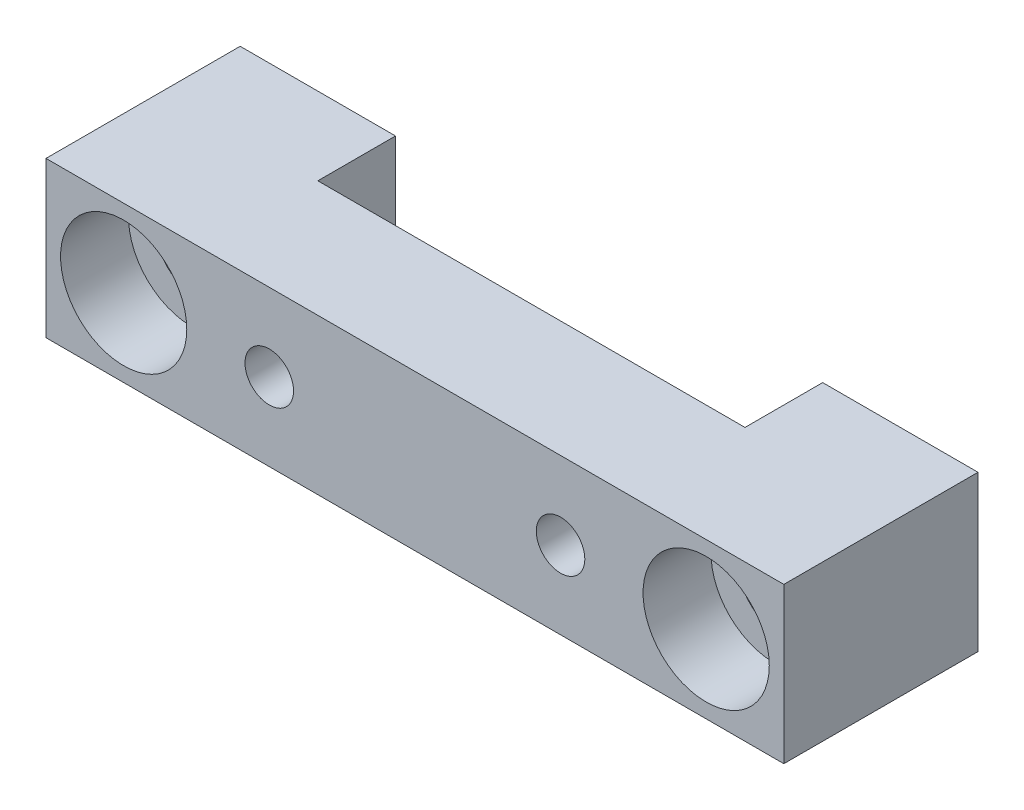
ISO-10303-21;
HEADER;
FILE_DESCRIPTION(('STEP AP214'),'2;1');
FILE_NAME('part.step','',(''),(''),'','','');
FILE_SCHEMA(('AUTOMOTIVE_DESIGN { 1 0 10303 214 1 1 1 1 }'));
ENDSEC;
DATA;
#1=APPLICATION_CONTEXT('core data for automotive mechanical design processes');
#2=APPLICATION_PROTOCOL_DEFINITION('international standard','automotive_design',2000,#1);
#3=PRODUCT_CONTEXT('',#1,'mechanical');
#4=PRODUCT('Part','Part','',(#3));
#5=PRODUCT_RELATED_PRODUCT_CATEGORY('part','',(#4));
#6=PRODUCT_DEFINITION_FORMATION('','',#4);
#7=PRODUCT_DEFINITION_CONTEXT('part definition',#1,'design');
#8=PRODUCT_DEFINITION('design','',#6,#7);
#9=PRODUCT_DEFINITION_SHAPE('','',#8);
#10=(LENGTH_UNIT() NAMED_UNIT(*) SI_UNIT(.MILLI.,.METRE.));
#11=(NAMED_UNIT(*) PLANE_ANGLE_UNIT() SI_UNIT($,.RADIAN.));
#12=(NAMED_UNIT(*) SI_UNIT($,.STERADIAN.) SOLID_ANGLE_UNIT());
#13=UNCERTAINTY_MEASURE_WITH_UNIT(LENGTH_MEASURE(1.E-05),#10,'distance_accuracy_value','');
#14=(GEOMETRIC_REPRESENTATION_CONTEXT(3) GLOBAL_UNCERTAINTY_ASSIGNED_CONTEXT((#13)) GLOBAL_UNIT_ASSIGNED_CONTEXT((#10,
#11,#12)) REPRESENTATION_CONTEXT('',''));
#15=CARTESIAN_POINT('',(0.,0.,0.));
#16=DIRECTION('',(0.,0.,1.));
#17=DIRECTION('',(1.,0.,0.));
#18=AXIS2_PLACEMENT_3D('',#15,#16,#17);
#19=CARTESIAN_POINT('',(0.,8.,0.));
#20=DIRECTION('',(0.,0.,-1.));
#21=DIRECTION('',(-1.,0.,0.));
#22=AXIS2_PLACEMENT_3D('',#19,#20,#21);
#23=PLANE('',#22);
#24=CARTESIAN_POINT('',(34.,4.00000000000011,0.));
#25=DIRECTION('',(0.,0.,1.));
#26=DIRECTION('',(1.,0.,0.));
#27=AXIS2_PLACEMENT_3D('',#24,#25,#26);
#28=CIRCLE('',#27,1.75);
#29=CARTESIAN_POINT('',(35.75,4.00000000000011,0.));
#30=VERTEX_POINT('',#29);
#31=EDGE_CURVE('E167',#30,#30,#28,.T.);
#32=ORIENTED_EDGE('',*,*,#31,.T.);
#33=EDGE_LOOP('',(#32));
#34=FACE_BOUND('',#33,.T.);
#35=DIRECTION('',(1.,0.,0.));
#36=VECTOR('',#35,1.);
#37=CARTESIAN_POINT('',(0.,0.,0.));
#38=LINE('',#37,#36);
#39=CARTESIAN_POINT('',(30.,0.,0.));
#40=VERTEX_POINT('',#39);
#41=CARTESIAN_POINT('',(38.,0.,0.));
#42=VERTEX_POINT('',#41);
#43=EDGE_CURVE('E181',#40,#42,#38,.T.);
#44=ORIENTED_EDGE('',*,*,#43,.F.);
#45=DIRECTION('',(0.,1.,0.));
#46=VECTOR('',#45,1.);
#47=CARTESIAN_POINT('',(30.,0.,0.));
#48=LINE('',#47,#46);
#49=CARTESIAN_POINT('',(30.,8.,0.));
#50=VERTEX_POINT('',#49);
#51=EDGE_CURVE('E137',#40,#50,#48,.T.);
#52=ORIENTED_EDGE('',*,*,#51,.T.);
#53=DIRECTION('',(-1.,0.,0.));
#54=VECTOR('',#53,1.);
#55=CARTESIAN_POINT('',(0.,8.,0.));
#56=LINE('',#55,#54);
#57=CARTESIAN_POINT('',(38.,8.,0.));
#58=VERTEX_POINT('',#57);
#59=EDGE_CURVE('E173',#58,#50,#56,.T.);
#60=ORIENTED_EDGE('',*,*,#59,.F.);
#61=DIRECTION('',(0.,1.,0.));
#62=VECTOR('',#61,1.);
#63=CARTESIAN_POINT('',(38.,0.,0.));
#64=LINE('',#63,#62);
#65=EDGE_CURVE('E183',#42,#58,#64,.T.);
#66=ORIENTED_EDGE('',*,*,#65,.F.);
#67=EDGE_LOOP('',(#44,#52,#60,#66));
#68=FACE_BOUND('',#67,.T.);
#69=ADVANCED_FACE('F33',(#34,#68),#23,.T.);
#70=CARTESIAN_POINT('',(4.,4.00000000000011,0.));
#71=DIRECTION('',(0.,0.,1.));
#72=DIRECTION('',(1.,0.,0.));
#73=AXIS2_PLACEMENT_3D('',#70,#71,#72);
#74=CIRCLE('',#73,1.75);
#75=CARTESIAN_POINT('',(5.75,4.00000000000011,0.));
#76=VERTEX_POINT('',#75);
#77=EDGE_CURVE('E164',#76,#76,#74,.T.);
#78=ORIENTED_EDGE('',*,*,#77,.T.);
#79=EDGE_LOOP('',(#78));
#80=FACE_BOUND('',#79,.T.);
#81=CARTESIAN_POINT('',(7.99999999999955,8.,0.));
#82=VERTEX_POINT('',#81);
#83=CARTESIAN_POINT('',(0.,8.,0.));
#84=VERTEX_POINT('',#83);
#85=EDGE_CURVE('E79',#82,#84,#56,.T.);
#86=ORIENTED_EDGE('',*,*,#85,.F.);
#87=DIRECTION('',(0.,1.,0.));
#88=VECTOR('',#87,1.);
#89=CARTESIAN_POINT('',(8.,0.,0.));
#90=LINE('',#89,#88);
#91=CARTESIAN_POINT('',(8.,0.,0.));
#92=VERTEX_POINT('',#91);
#93=EDGE_CURVE('E50',#92,#82,#90,.T.);
#94=ORIENTED_EDGE('',*,*,#93,.F.);
#95=CARTESIAN_POINT('',(0.,0.,0.));
#96=VERTEX_POINT('',#95);
#97=EDGE_CURVE('E127',#96,#92,#38,.T.);
#98=ORIENTED_EDGE('',*,*,#97,.F.);
#99=DIRECTION('',(0.,-1.,0.));
#100=VECTOR('',#99,1.);
#101=CARTESIAN_POINT('',(0.,0.,0.));
#102=LINE('',#101,#100);
#103=EDGE_CURVE('E170',#84,#96,#102,.T.);
#104=ORIENTED_EDGE('',*,*,#103,.F.);
#105=EDGE_LOOP('',(#86,#94,#98,#104));
#106=FACE_BOUND('',#105,.T.);
#107=ADVANCED_FACE('F245',(#80,#106),#23,.T.);
#108=CARTESIAN_POINT('',(0.,0.,10.));
#109=DIRECTION('',(0.,1.,0.));
#110=DIRECTION('',(0.,0.,1.));
#111=AXIS2_PLACEMENT_3D('',#108,#109,#110);
#112=PLANE('',#111);
#113=DIRECTION('',(-2.27248775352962E-13,0.,1.));
#114=VECTOR('',#113,1.);
#115=CARTESIAN_POINT('',(29.9999999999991,0.,4.));
#116=LINE('',#115,#114);
#117=CARTESIAN_POINT('',(29.9999999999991,0.,4.));
#118=VERTEX_POINT('',#117);
#119=EDGE_CURVE('E115',#40,#118,#116,.T.);
#120=ORIENTED_EDGE('',*,*,#119,.F.);
#121=ORIENTED_EDGE('',*,*,#43,.T.);
#122=DIRECTION('',(0.,0.,-1.));
#123=VECTOR('',#122,1.);
#124=CARTESIAN_POINT('',(38.,0.,10.));
#125=LINE('',#124,#123);
#126=CARTESIAN_POINT('',(38.,0.,10.));
#127=VERTEX_POINT('',#126);
#128=EDGE_CURVE('E42',#127,#42,#125,.T.);
#129=ORIENTED_EDGE('',*,*,#128,.F.);
#130=DIRECTION('',(1.,0.,0.));
#131=VECTOR('',#130,1.);
#132=CARTESIAN_POINT('',(0.,0.,10.));
#133=LINE('',#132,#131);
#134=CARTESIAN_POINT('',(0.,0.,10.));
#135=VERTEX_POINT('',#134);
#136=EDGE_CURVE('E86',#135,#127,#133,.T.);
#137=ORIENTED_EDGE('',*,*,#136,.F.);
#138=DIRECTION('',(0.,0.,-1.));
#139=VECTOR('',#138,1.);
#140=CARTESIAN_POINT('',(0.,0.,10.));
#141=LINE('',#140,#139);
#142=EDGE_CURVE('E12',#135,#96,#141,.T.);
#143=ORIENTED_EDGE('',*,*,#142,.T.);
#144=ORIENTED_EDGE('',*,*,#97,.T.);
#145=DIRECTION('',(2.27248775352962E-13,0.,-1.));
#146=VECTOR('',#145,1.);
#147=CARTESIAN_POINT('',(7.99999999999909,0.,4.));
#148=LINE('',#147,#146);
#149=CARTESIAN_POINT('',(7.99999999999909,0.,4.));
#150=VERTEX_POINT('',#149);
#151=EDGE_CURVE('E110',#150,#92,#148,.T.);
#152=ORIENTED_EDGE('',*,*,#151,.F.);
#153=DIRECTION('',(-1.,0.,0.));
#154=VECTOR('',#153,1.);
#155=CARTESIAN_POINT('',(7.99999999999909,0.,4.));
#156=LINE('',#155,#154);
#157=EDGE_CURVE('E118',#118,#150,#156,.T.);
#158=ORIENTED_EDGE('',*,*,#157,.F.);
#159=EDGE_LOOP('',(#120,#121,#129,#137,#143,#144,#152,#158));
#160=FACE_BOUND('',#159,.T.);
#161=ADVANCED_FACE('F126',(#160),#112,.F.);
#162=CARTESIAN_POINT('',(0.,8.,10.));
#163=DIRECTION('',(0.,-1.,0.));
#164=DIRECTION('',(0.,0.,-1.));
#165=AXIS2_PLACEMENT_3D('',#162,#163,#164);
#166=PLANE('',#165);
#167=DIRECTION('',(-2.27248775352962E-13,0.,1.));
#168=VECTOR('',#167,1.);
#169=CARTESIAN_POINT('',(29.9999999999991,8.,4.));
#170=LINE('',#169,#168);
#171=CARTESIAN_POINT('',(29.9999999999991,8.,4.));
#172=VERTEX_POINT('',#171);
#173=EDGE_CURVE('E123',#50,#172,#170,.T.);
#174=ORIENTED_EDGE('',*,*,#173,.T.);
#175=DIRECTION('',(-1.,0.,0.));
#176=VECTOR('',#175,1.);
#177=CARTESIAN_POINT('',(7.99999999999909,8.,4.));
#178=LINE('',#177,#176);
#179=CARTESIAN_POINT('',(7.99999999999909,8.,4.));
#180=VERTEX_POINT('',#179);
#181=EDGE_CURVE('E131',#172,#180,#178,.T.);
#182=ORIENTED_EDGE('',*,*,#181,.T.);
#183=DIRECTION('',(2.27248775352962E-13,0.,-1.));
#184=VECTOR('',#183,1.);
#185=CARTESIAN_POINT('',(7.99999999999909,8.,4.));
#186=LINE('',#185,#184);
#187=EDGE_CURVE('E111',#180,#82,#186,.T.);
#188=ORIENTED_EDGE('',*,*,#187,.T.);
#189=ORIENTED_EDGE('',*,*,#85,.T.);
#190=DIRECTION('',(0.,0.,-1.));
#191=VECTOR('',#190,1.);
#192=CARTESIAN_POINT('',(0.,8.,10.));
#193=LINE('',#192,#191);
#194=CARTESIAN_POINT('',(0.,8.,10.));
#195=VERTEX_POINT('',#194);
#196=EDGE_CURVE('E178',#195,#84,#193,.T.);
#197=ORIENTED_EDGE('',*,*,#196,.F.);
#198=DIRECTION('',(-1.,0.,0.));
#199=VECTOR('',#198,1.);
#200=CARTESIAN_POINT('',(0.,8.,10.));
#201=LINE('',#200,#199);
#202=CARTESIAN_POINT('',(38.,8.,10.));
#203=VERTEX_POINT('',#202);
#204=EDGE_CURVE('E59',#203,#195,#201,.T.);
#205=ORIENTED_EDGE('',*,*,#204,.F.);
#206=DIRECTION('',(0.,0.,-1.));
#207=VECTOR('',#206,1.);
#208=CARTESIAN_POINT('',(38.,8.,10.));
#209=LINE('',#208,#207);
#210=EDGE_CURVE('E188',#203,#58,#209,.T.);
#211=ORIENTED_EDGE('',*,*,#210,.T.);
#212=ORIENTED_EDGE('',*,*,#59,.T.);
#213=EDGE_LOOP('',(#174,#182,#188,#189,#197,#205,#211,#212));
#214=FACE_BOUND('',#213,.T.);
#215=ADVANCED_FACE('F255',(#214),#166,.F.);
#216=CARTESIAN_POINT('',(26.5,4.,10.));
#217=DIRECTION('',(0.,0.,-1.));
#218=DIRECTION('',(-1.,0.,0.));
#219=AXIS2_PLACEMENT_3D('',#216,#217,#218);
#220=CYLINDRICAL_SURFACE('',#219,1.25);
#221=CARTESIAN_POINT('',(26.5,4.,10.));
#222=DIRECTION('',(0.,0.,1.));
#223=DIRECTION('',(1.,0.,0.));
#224=AXIS2_PLACEMENT_3D('',#221,#222,#223);
#225=CIRCLE('',#224,1.25);
#226=CARTESIAN_POINT('',(27.75,4.,10.));
#227=VERTEX_POINT('',#226);
#228=EDGE_CURVE('E161',#227,#227,#225,.T.);
#229=ORIENTED_EDGE('',*,*,#228,.T.);
#230=EDGE_LOOP('',(#229));
#231=FACE_BOUND('',#230,.T.);
#232=CARTESIAN_POINT('',(26.5,4.,4.));
#233=DIRECTION('',(0.,0.,-1.));
#234=DIRECTION('',(-1.,0.,0.));
#235=AXIS2_PLACEMENT_3D('',#232,#233,#234);
#236=CIRCLE('',#235,1.25);
#237=CARTESIAN_POINT('',(25.25,4.,4.));
#238=VERTEX_POINT('',#237);
#239=EDGE_CURVE('E141',#238,#238,#236,.T.);
#240=ORIENTED_EDGE('',*,*,#239,.T.);
#241=EDGE_LOOP('',(#240));
#242=FACE_BOUND('',#241,.T.);
#243=ADVANCED_FACE('F228',(#231,#242),#220,.F.);
#244=CARTESIAN_POINT('',(11.5,4.,10.));
#245=DIRECTION('',(0.,0.,-1.));
#246=DIRECTION('',(-1.,0.,0.));
#247=AXIS2_PLACEMENT_3D('',#244,#245,#246);
#248=CYLINDRICAL_SURFACE('',#247,1.25);
#249=CARTESIAN_POINT('',(11.5,4.,10.));
#250=DIRECTION('',(0.,0.,1.));
#251=DIRECTION('',(1.,0.,0.));
#252=AXIS2_PLACEMENT_3D('',#249,#250,#251);
#253=CIRCLE('',#252,1.25);
#254=CARTESIAN_POINT('',(12.75,4.,10.));
#255=VERTEX_POINT('',#254);
#256=EDGE_CURVE('E158',#255,#255,#253,.T.);
#257=ORIENTED_EDGE('',*,*,#256,.T.);
#258=EDGE_LOOP('',(#257));
#259=FACE_BOUND('',#258,.T.);
#260=CARTESIAN_POINT('',(11.5,4.,4.));
#261=DIRECTION('',(0.,0.,-1.));
#262=DIRECTION('',(-1.,0.,0.));
#263=AXIS2_PLACEMENT_3D('',#260,#261,#262);
#264=CIRCLE('',#263,1.25);
#265=CARTESIAN_POINT('',(10.25,4.,4.));
#266=VERTEX_POINT('',#265);
#267=EDGE_CURVE('E37',#266,#266,#264,.T.);
#268=ORIENTED_EDGE('',*,*,#267,.T.);
#269=EDGE_LOOP('',(#268));
#270=FACE_BOUND('',#269,.T.);
#271=ADVANCED_FACE('F225',(#259,#270),#248,.F.);
#272=CARTESIAN_POINT('',(4.,4.00000000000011,10.));
#273=DIRECTION('',(0.,0.,-1.));
#274=DIRECTION('',(-1.,0.,0.));
#275=AXIS2_PLACEMENT_3D('',#272,#273,#274);
#276=CYLINDRICAL_SURFACE('',#275,1.75);
#277=ORIENTED_EDGE('',*,*,#77,.F.);
#278=EDGE_LOOP('',(#277));
#279=FACE_BOUND('',#278,.T.);
#280=CARTESIAN_POINT('',(4.,4.00000000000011,6.5));
#281=DIRECTION('',(0.,0.,1.));
#282=DIRECTION('',(1.,0.,0.));
#283=AXIS2_PLACEMENT_3D('',#280,#281,#282);
#284=CIRCLE('',#283,1.75);
#285=CARTESIAN_POINT('',(5.75,4.00000000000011,6.5));
#286=VERTEX_POINT('',#285);
#287=EDGE_CURVE('E148',#286,#286,#284,.T.);
#288=ORIENTED_EDGE('',*,*,#287,.T.);
#289=EDGE_LOOP('',(#288));
#290=FACE_BOUND('',#289,.T.);
#291=ADVANCED_FACE('F197',(#279,#290),#276,.F.);
#292=CARTESIAN_POINT('',(34.,4.00000000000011,10.));
#293=DIRECTION('',(0.,0.,-1.));
#294=DIRECTION('',(-1.,0.,0.));
#295=AXIS2_PLACEMENT_3D('',#292,#293,#294);
#296=CYLINDRICAL_SURFACE('',#295,1.75);
#297=ORIENTED_EDGE('',*,*,#31,.F.);
#298=EDGE_LOOP('',(#297));
#299=FACE_BOUND('',#298,.T.);
#300=CARTESIAN_POINT('',(34.,4.00000000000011,6.5));
#301=DIRECTION('',(0.,0.,1.));
#302=DIRECTION('',(1.,0.,0.));
#303=AXIS2_PLACEMENT_3D('',#300,#301,#302);
#304=CIRCLE('',#303,1.75);
#305=CARTESIAN_POINT('',(35.75,4.00000000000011,6.5));
#306=VERTEX_POINT('',#305);
#307=EDGE_CURVE('E154',#306,#306,#304,.T.);
#308=ORIENTED_EDGE('',*,*,#307,.T.);
#309=EDGE_LOOP('',(#308));
#310=FACE_BOUND('',#309,.T.);
#311=ADVANCED_FACE('F215',(#299,#310),#296,.F.);
#312=CARTESIAN_POINT('',(0.,8.,10.));
#313=DIRECTION('',(0.,0.,-1.));
#314=DIRECTION('',(-1.,0.,0.));
#315=AXIS2_PLACEMENT_3D('',#312,#313,#314);
#316=PLANE('',#315);
#317=CARTESIAN_POINT('',(4.,4.00000000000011,10.));
#318=DIRECTION('',(0.,0.,1.));
#319=DIRECTION('',(1.,0.,0.));
#320=AXIS2_PLACEMENT_3D('',#317,#318,#319);
#321=CIRCLE('',#320,3.25);
#322=CARTESIAN_POINT('',(7.25,4.00000000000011,10.));
#323=VERTEX_POINT('',#322);
#324=EDGE_CURVE('E144',#323,#323,#321,.T.);
#325=ORIENTED_EDGE('',*,*,#324,.F.);
#326=EDGE_LOOP('',(#325));
#327=FACE_BOUND('',#326,.T.);
#328=CARTESIAN_POINT('',(34.,4.00000000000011,10.));
#329=DIRECTION('',(0.,0.,1.));
#330=DIRECTION('',(1.,0.,0.));
#331=AXIS2_PLACEMENT_3D('',#328,#329,#330);
#332=CIRCLE('',#331,3.25);
#333=CARTESIAN_POINT('',(37.25,4.00000000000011,10.));
#334=VERTEX_POINT('',#333);
#335=EDGE_CURVE('E155',#334,#334,#332,.T.);
#336=ORIENTED_EDGE('',*,*,#335,.F.);
#337=EDGE_LOOP('',(#336));
#338=FACE_BOUND('',#337,.T.);
#339=ORIENTED_EDGE('',*,*,#228,.F.);
#340=EDGE_LOOP('',(#339));
#341=FACE_BOUND('',#340,.T.);
#342=DIRECTION('',(0.,-1.,0.));
#343=VECTOR('',#342,1.);
#344=CARTESIAN_POINT('',(0.,0.,10.));
#345=LINE('',#344,#343);
#346=EDGE_CURVE('E171',#195,#135,#345,.T.);
#347=ORIENTED_EDGE('',*,*,#346,.T.);
#348=ORIENTED_EDGE('',*,*,#136,.T.);
#349=DIRECTION('',(0.,1.,0.));
#350=VECTOR('',#349,1.);
#351=CARTESIAN_POINT('',(38.,0.,10.));
#352=LINE('',#351,#350);
#353=EDGE_CURVE('E175',#127,#203,#352,.T.);
#354=ORIENTED_EDGE('',*,*,#353,.T.);
#355=ORIENTED_EDGE('',*,*,#204,.T.);
#356=EDGE_LOOP('',(#347,#348,#354,#355));
#357=FACE_BOUND('',#356,.T.);
#358=ORIENTED_EDGE('',*,*,#256,.F.);
#359=EDGE_LOOP('',(#358));
#360=FACE_BOUND('',#359,.T.);
#361=ADVANCED_FACE('F212',(#327,#338,#341,#357,#360),#316,.F.);
#362=CARTESIAN_POINT('',(0.,0.,10.));
#363=DIRECTION('',(1.,0.,0.));
#364=DIRECTION('',(0.,0.,-1.));
#365=AXIS2_PLACEMENT_3D('',#362,#363,#364);
#366=PLANE('',#365);
#367=ORIENTED_EDGE('',*,*,#103,.T.);
#368=ORIENTED_EDGE('',*,*,#142,.F.);
#369=ORIENTED_EDGE('',*,*,#346,.F.);
#370=ORIENTED_EDGE('',*,*,#196,.T.);
#371=EDGE_LOOP('',(#367,#368,#369,#370));
#372=FACE_BOUND('',#371,.T.);
#373=ADVANCED_FACE('F35',(#372),#366,.F.);
#374=CARTESIAN_POINT('',(38.,0.,10.));
#375=DIRECTION('',(-1.,0.,0.));
#376=DIRECTION('',(0.,0.,1.));
#377=AXIS2_PLACEMENT_3D('',#374,#375,#376);
#378=PLANE('',#377);
#379=ORIENTED_EDGE('',*,*,#65,.T.);
#380=ORIENTED_EDGE('',*,*,#210,.F.);
#381=ORIENTED_EDGE('',*,*,#353,.F.);
#382=ORIENTED_EDGE('',*,*,#128,.T.);
#383=EDGE_LOOP('',(#379,#380,#381,#382));
#384=FACE_BOUND('',#383,.T.);
#385=ADVANCED_FACE('F258',(#384),#378,.F.);
#386=CARTESIAN_POINT('',(34.,4.00000000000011,6.5));
#387=DIRECTION('',(0.,0.,1.));
#388=DIRECTION('',(1.,0.,0.));
#389=AXIS2_PLACEMENT_3D('',#386,#387,#388);
#390=CYLINDRICAL_SURFACE('',#389,3.25);
#391=CARTESIAN_POINT('',(34.,4.00000000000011,6.5));
#392=DIRECTION('',(0.,0.,1.));
#393=DIRECTION('',(1.,0.,0.));
#394=AXIS2_PLACEMENT_3D('',#391,#392,#393);
#395=CIRCLE('',#394,3.25);
#396=CARTESIAN_POINT('',(37.25,4.00000000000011,6.5));
#397=VERTEX_POINT('',#396);
#398=EDGE_CURVE('E151',#397,#397,#395,.T.);
#399=ORIENTED_EDGE('',*,*,#398,.F.);
#400=EDGE_LOOP('',(#399));
#401=FACE_BOUND('',#400,.T.);
#402=ORIENTED_EDGE('',*,*,#335,.T.);
#403=EDGE_LOOP('',(#402));
#404=FACE_BOUND('',#403,.T.);
#405=ADVANCED_FACE('F260',(#401,#404),#390,.F.);
#406=CARTESIAN_POINT('',(34.,4.00000000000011,6.5));
#407=DIRECTION('',(0.,0.,1.));
#408=DIRECTION('',(1.,0.,0.));
#409=AXIS2_PLACEMENT_3D('',#406,#407,#408);
#410=PLANE('',#409);
#411=ORIENTED_EDGE('',*,*,#307,.F.);
#412=EDGE_LOOP('',(#411));
#413=FACE_BOUND('',#412,.T.);
#414=ORIENTED_EDGE('',*,*,#398,.T.);
#415=EDGE_LOOP('',(#414));
#416=FACE_BOUND('',#415,.T.);
#417=ADVANCED_FACE('F208',(#413,#416),#410,.T.);
#418=CARTESIAN_POINT('',(4.,4.00000000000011,6.5));
#419=DIRECTION('',(0.,0.,1.));
#420=DIRECTION('',(1.,0.,0.));
#421=AXIS2_PLACEMENT_3D('',#418,#419,#420);
#422=CYLINDRICAL_SURFACE('',#421,3.25);
#423=CARTESIAN_POINT('',(4.,4.00000000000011,6.5));
#424=DIRECTION('',(0.,0.,1.));
#425=DIRECTION('',(1.,0.,0.));
#426=AXIS2_PLACEMENT_3D('',#423,#424,#425);
#427=CIRCLE('',#426,3.25);
#428=CARTESIAN_POINT('',(7.25,4.00000000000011,6.5));
#429=VERTEX_POINT('',#428);
#430=EDGE_CURVE('E145',#429,#429,#427,.T.);
#431=ORIENTED_EDGE('',*,*,#430,.F.);
#432=EDGE_LOOP('',(#431));
#433=FACE_BOUND('',#432,.T.);
#434=ORIENTED_EDGE('',*,*,#324,.T.);
#435=EDGE_LOOP('',(#434));
#436=FACE_BOUND('',#435,.T.);
#437=ADVANCED_FACE('F202',(#433,#436),#422,.F.);
#438=CARTESIAN_POINT('',(4.,4.00000000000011,6.5));
#439=DIRECTION('',(0.,0.,1.));
#440=DIRECTION('',(1.,0.,0.));
#441=AXIS2_PLACEMENT_3D('',#438,#439,#440);
#442=PLANE('',#441);
#443=ORIENTED_EDGE('',*,*,#287,.F.);
#444=EDGE_LOOP('',(#443));
#445=FACE_BOUND('',#444,.T.);
#446=ORIENTED_EDGE('',*,*,#430,.T.);
#447=EDGE_LOOP('',(#446));
#448=FACE_BOUND('',#447,.T.);
#449=ADVANCED_FACE('F199',(#445,#448),#442,.T.);
#450=CARTESIAN_POINT('',(7.99999999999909,0.,4.));
#451=DIRECTION('',(0.,0.,-1.));
#452=DIRECTION('',(-1.,0.,0.));
#453=AXIS2_PLACEMENT_3D('',#450,#451,#452);
#454=PLANE('',#453);
#455=ORIENTED_EDGE('',*,*,#239,.F.);
#456=EDGE_LOOP('',(#455));
#457=FACE_BOUND('',#456,.T.);
#458=ORIENTED_EDGE('',*,*,#267,.F.);
#459=EDGE_LOOP('',(#458));
#460=FACE_BOUND('',#459,.T.);
#461=ORIENTED_EDGE('',*,*,#181,.F.);
#462=DIRECTION('',(0.,1.,0.));
#463=VECTOR('',#462,1.);
#464=CARTESIAN_POINT('',(29.9999999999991,0.,4.));
#465=LINE('',#464,#463);
#466=EDGE_CURVE('E120',#118,#172,#465,.T.);
#467=ORIENTED_EDGE('',*,*,#466,.F.);
#468=ORIENTED_EDGE('',*,*,#157,.T.);
#469=DIRECTION('',(0.,1.,0.));
#470=VECTOR('',#469,1.);
#471=CARTESIAN_POINT('',(7.99999999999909,0.,4.));
#472=LINE('',#471,#470);
#473=EDGE_CURVE('E106',#150,#180,#472,.T.);
#474=ORIENTED_EDGE('',*,*,#473,.T.);
#475=EDGE_LOOP('',(#461,#467,#468,#474));
#476=FACE_BOUND('',#475,.T.);
#477=ADVANCED_FACE('F119',(#457,#460,#476),#454,.T.);
#478=CARTESIAN_POINT('',(29.9999999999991,0.,4.));
#479=DIRECTION('',(-1.,0.,-2.27248775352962E-13));
#480=DIRECTION('',(-2.27248775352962E-13,0.,1.));
#481=AXIS2_PLACEMENT_3D('',#478,#479,#480);
#482=PLANE('',#481);
#483=ORIENTED_EDGE('',*,*,#173,.F.);
#484=ORIENTED_EDGE('',*,*,#51,.F.);
#485=ORIENTED_EDGE('',*,*,#119,.T.);
#486=ORIENTED_EDGE('',*,*,#466,.T.);
#487=EDGE_LOOP('',(#483,#484,#485,#486));
#488=FACE_BOUND('',#487,.T.);
#489=ADVANCED_FACE('F234',(#488),#482,.T.);
#490=CARTESIAN_POINT('',(7.99999999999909,0.,4.));
#491=DIRECTION('',(1.,0.,2.27248775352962E-13));
#492=DIRECTION('',(2.27248775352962E-13,0.,-1.));
#493=AXIS2_PLACEMENT_3D('',#490,#491,#492);
#494=PLANE('',#493);
#495=ORIENTED_EDGE('',*,*,#187,.F.);
#496=ORIENTED_EDGE('',*,*,#473,.F.);
#497=ORIENTED_EDGE('',*,*,#151,.T.);
#498=ORIENTED_EDGE('',*,*,#93,.T.);
#499=EDGE_LOOP('',(#495,#496,#497,#498));
#500=FACE_BOUND('',#499,.T.);
#501=ADVANCED_FACE('F108',(#500),#494,.T.);
#502=CLOSED_SHELL('',(#69,#107,#161,#215,#243,#271,#291,#311,#361,#373,#385,#405,#417,#437,#449,
#477,#489,#501));
#503=MANIFOLD_SOLID_BREP('B2',#502);
#504=ADVANCED_BREP_SHAPE_REPRESENTATION('',(#18,#503),#14);
#505=SHAPE_DEFINITION_REPRESENTATION(#9,#504);
ENDSEC;
END-ISO-10303-21;
